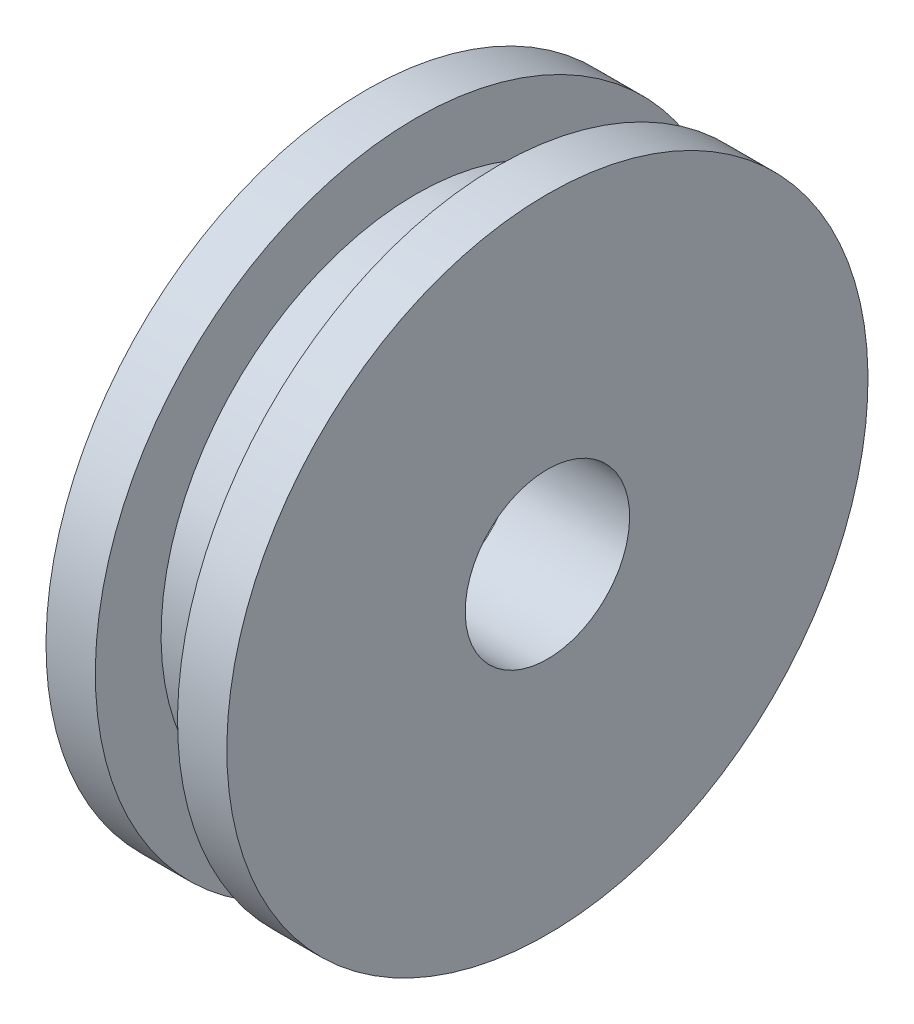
from build123d import *

# Parameters (mm, degrees)
ESQUISSE2_R             = 2.5
ENL_V_MAT_EXTRU_1_DEPTH = 15.845032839
ESQUISSE3_R             = 6
ENL_V_MAT_EXTRU_2_DEPTH = 2
CHANFREIN1_SIZE         = 0.5


with BuildPart() as part:
    # Esquisse1 → Base-R_volution (revolve)
    with BuildSketch(Plane.XY):
        Polygon((15.437199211, 0), (20.937199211, 0), (20.937199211, 9.75), (19.437199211, 9.75), (19.437199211, 7.75), (16.937199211, 7.75), (16.937199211, 9.75), (15.437199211, 9.75), align=None)
    revolve(axis=Axis((20.937199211, 0, 0), (-1, 0, 0)))

    # Esquisse2 → Enl_v. mat.-Extru.1 (cut, through all)
    with BuildSketch(Plane(origin=(20.937199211, 0, 0), x_dir=(0, 0, -1), z_dir=(1, 0, 0))):
        with Locations(Location((0, 0, 0), (0, 0, 90))):
            Circle(ESQUISSE2_R)
    extrude(amount=-ENL_V_MAT_EXTRU_1_DEPTH, mode=Mode.SUBTRACT)

    # Esquisse3 → Enl_v. mat.-Extru.2 (cut)
    with BuildSketch(Plane.ZY.offset(-15.437199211)):
        with Locations(Location((0, 0, 0), (0, 0, 270))):
            Circle(ESQUISSE3_R)
    extrude(amount=-ENL_V_MAT_EXTRU_2_DEPTH, mode=Mode.SUBTRACT)

    # Chanfrein1
    chanfrein1_edges = [part.edges().sort_by_distance(p)[0] for p in [
        (15.437199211, 6, 0),
    ]]
    chamfer(chanfrein1_edges, length=CHANFREIN1_SIZE)


solid = part.part
